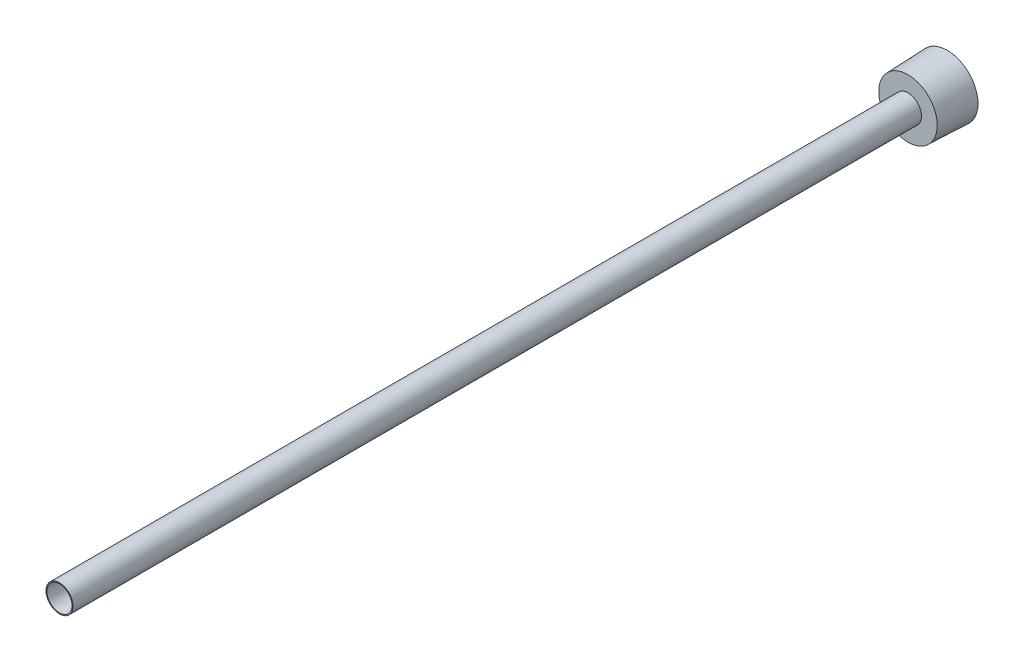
from build123d import *

# Parameters (mm, degrees)
SKETCH2_R          = 4.318
CUT_EXTRUDE1_DEPTH = 306.164325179
CUT_EXTRUDE2_DEPTH = 9.525


with BuildPart() as part:
    # Sketch1 → Revolve1 (revolve)
    with BuildSketch(Plane(origin=(0, 0, 0), x_dir=(0, 0, -1), z_dir=(1, 0, 0)), mode=Mode.PRIVATE) as revolve1_sk:
        Polygon((0, 10.541), (-13.4874, 10.049032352), (-13.4874, 4.6355), (-304.8, 4.6355), (-304.8, 0), (0, 0), align=None)
    revolve(revolve1_sk.sketch.rotate(Axis((0, 0, 223.212151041), (0, 0, -1)), 90), axis=Axis((0, 0, 223.212151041), (0, 0, -1)))

    # Sketch2 → Cut-Extrude1 (cut, through all)
    with BuildSketch(Plane.XY.offset(304.8)):
        Circle(SKETCH2_R)
    extrude(amount=-CUT_EXTRUDE1_DEPTH, mode=Mode.SUBTRACT)

    # Sketch3 → Cut-Extrude2 (cut)
    with BuildSketch(Plane(origin=(0, 0, 0), x_dir=(-1, 0, 0), z_dir=(0, 0, -1))):
        Polygon((0, -7.332348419), (6.35, -3.666174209), (6.35, 3.666174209), (0, 7.332348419), (-6.35, 3.666174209), (-6.35, -3.666174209), align=None)
    extrude(amount=-CUT_EXTRUDE2_DEPTH, mode=Mode.SUBTRACT)


solid = part.part
